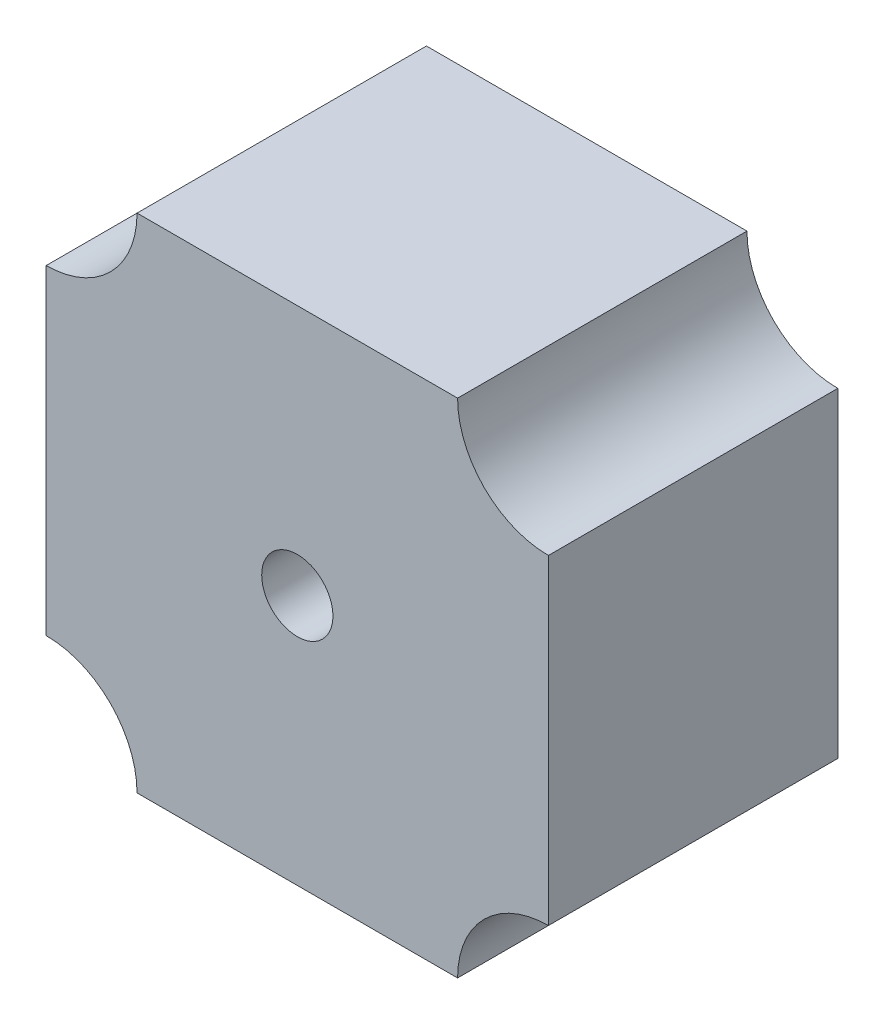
from build123d import *

# Parameters (mm, degrees)
EXTRUDE_1_DEPTH     = 32.5
SKETCH_3_R          = 4
CUT_EXTRUDE_1_DEPTH = 32.5


with BuildPart() as part:
    # Sketch 2 → Extrude 1 (new body)
    with BuildSketch(Plane.XY):
        with BuildLine():
            Line((18, -28.2), (-18, -28.2))
            ThreePointArc((-18, -28.2), (-20.987510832, -20.987510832), (-28.2, -18))
            Line((-28.2, -18), (-28.2, 18))
            ThreePointArc((-28.2, 18), (-20.987510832, 20.987510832), (-18, 28.2))
            Line((-18, 28.2), (18, 28.2))
            ThreePointArc((18, 28.2), (20.987510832, 20.987510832), (28.2, 18))
            Line((28.2, 18), (28.2, -18))
            ThreePointArc((28.2, -18), (20.987510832, -20.987510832), (18, -28.2))
        make_face()
    extrude(amount=EXTRUDE_1_DEPTH)

    # Sketch 3 → Cut-Extrude 1 (cut)
    with BuildSketch(Plane(origin=(0, 0, 0), x_dir=(-1, 0, 0), z_dir=(0, 0, -1))):
        Circle(SKETCH_3_R)
    extrude(amount=-CUT_EXTRUDE_1_DEPTH, mode=Mode.SUBTRACT)


solid = part.part
